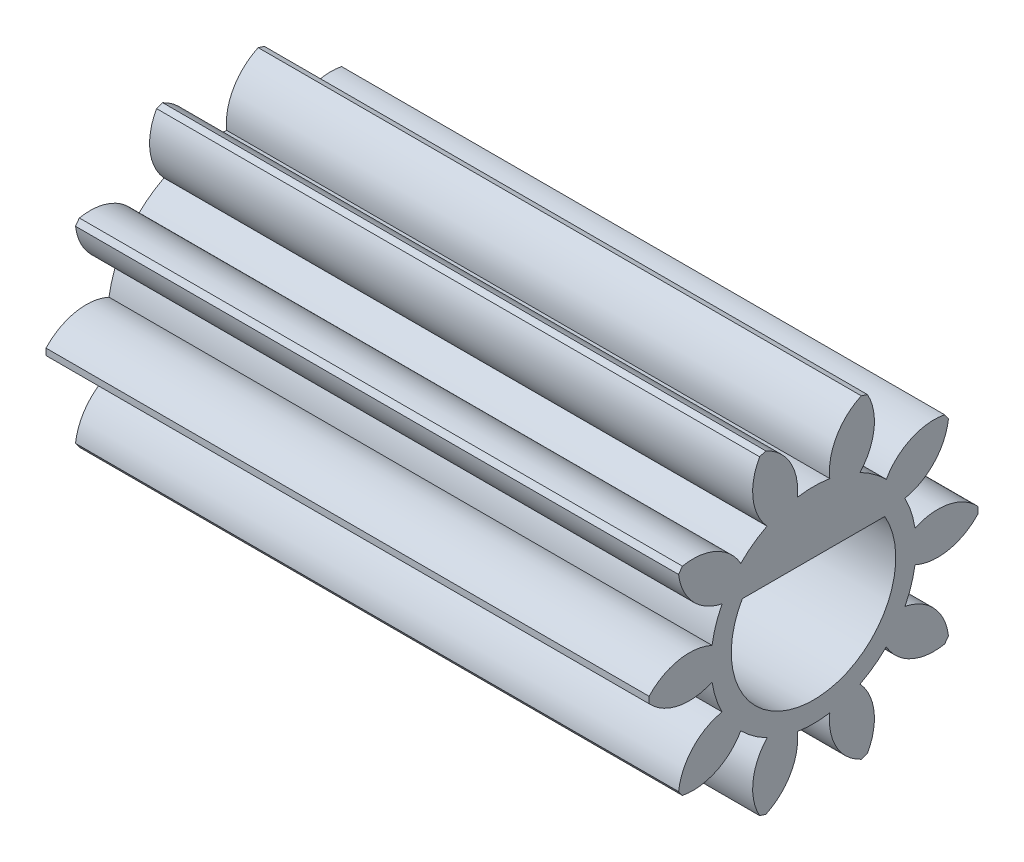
from build123d import *

# Parameters (mm, degrees)
BASPROSKE_W     = 11
BASPROSKE_H     = 3
TOOTHCUT_DEPTH  = 12.789826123
TEETHCUTS_COUNT = 10
BORE_DEPTH      = 50.0000508


with BuildPart() as part:
    # BasProSke → Base-Revolve (revolve)
    with BuildSketch(Plane(origin=(0, 0, 0), x_dir=(1, 0, 0), z_dir=(0, 1, 0)), mode=Mode.PRIVATE) as base_revolve_sk:
        with Locations((5.5, 1.5)):
            Rectangle(BASPROSKE_W, BASPROSKE_H)
    revolve(base_revolve_sk.sketch.rotate(Axis((-10, 0, 0), (1, 0, 0)), 180), axis=Axis((-10, 0, 0), (1, 0, 0)))

    # TooCutSke → ToothCut (cut, through all)
    with BuildSketch(Plane(origin=(0, 0, 0), x_dir=(0, 0, -1), z_dir=(1, 0, 0))):
        with BuildLine():
            ThreePointArc((0.296449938, 1.850403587), (0, 1.874), (-0.296449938, 1.850403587))
            ThreePointArc((-0.296449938, 1.850403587), (-0.428089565, 2.470295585), (-0.905889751, 2.886591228))
            ThreePointArc((-0.905889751, 2.886591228), (0, 3.0254), (0.905889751, 2.886591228))
            ThreePointArc((0.905889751, 2.886591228), (0.428089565, 2.470295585), (0.296449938, 1.850403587))
        make_face()
    toothcut = extrude(amount=TOOTHCUT_DEPTH, mode=Mode.SUBTRACT)

    # TeethCuts: ToothCut ×10 about axis
    teethcuts_axis = Axis((0, 0, 0), (1, 0, 0))
    for i in range(1, TEETHCUTS_COUNT):
        add(toothcut.rotate(teethcuts_axis, i * 360 / TEETHCUTS_COUNT), mode=Mode.SUBTRACT)

    # BorSke → Bore (cut, symmetric)
    with BuildSketch(Plane(origin=(0, 0, 0), x_dir=(0, 0, -1), z_dir=(1, 0, 0))):
        with BuildLine():
            Line((-1.299038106, 0.75), (1.299038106, 0.75))
            ThreePointArc((1.299038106, 0.75), (0, -1.5), (-1.299038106, 0.75))
        make_face()
    extrude(amount=BORE_DEPTH, both=True, mode=Mode.SUBTRACT)


solid = part.part
